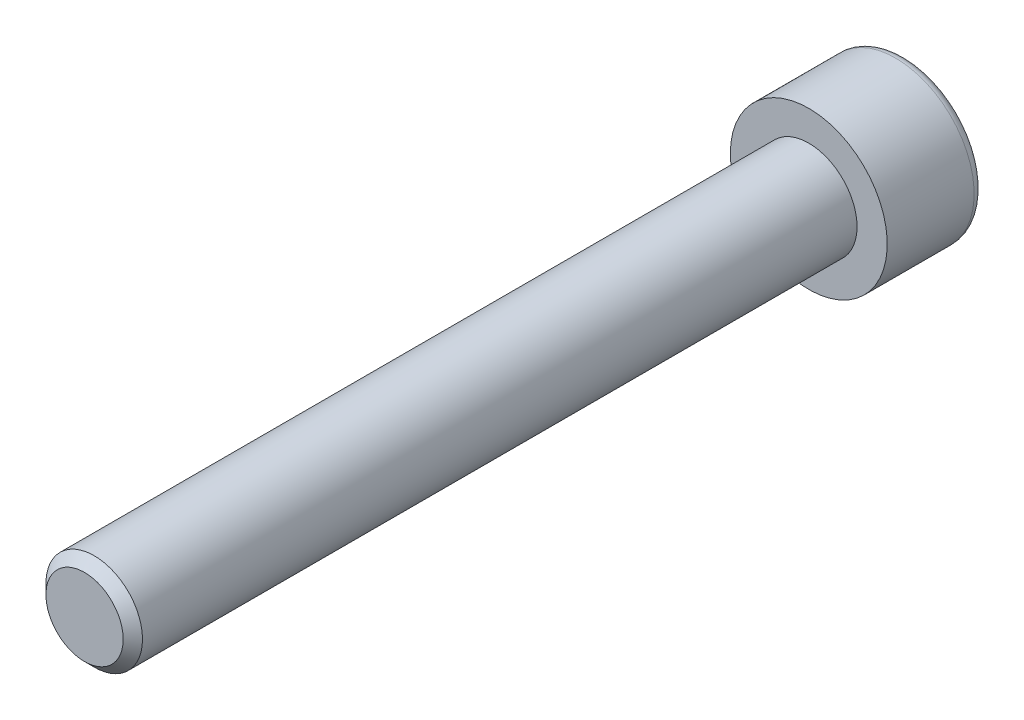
from build123d import *

# Parameters (mm, degrees)
ENLEV_MAT_EXTRU1_DEPTH = 4
ESQUISSE3_W            = 4
ESQUISSE3_H            = 60
CHANFREIN1_SIZE        = 0.8


with BuildPart() as part:
    # Esquisse1 → Base-R_volution (revolve)
    with BuildSketch(Plane(origin=(0, 0, 0), x_dir=(1, 0, 0), z_dir=(0, 1, 0)), mode=Mode.PRIVATE) as base_r_volution_sk:
        with BuildLine():
            Line((0, 0), (6.5, 0))
            Line((6.5, 0), (6.5, 7.2))
            ThreePointArc((6.5, 7.2), (6.265685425, 7.765685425), (5.7, 8))
            Line((5.7, 8), (0, 8))
            Line((0, 8), (0, 0))
        make_face()
    revolve(base_r_volution_sk.sketch.rotate(Axis((0, 0, 0), (0, 0, -1)), 180), axis=Axis((0, 0, 0), (0, 0, -1)))

    # Esquisse2 → enlev-mat-Extru1 (cut)
    with BuildSketch(Plane.XY.offset(-8)):
        Polygon((3, -1.732050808), (3, 1.732050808), (0, 3.464101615), (-3, 1.732050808), (-3, -1.732050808), (0, -3.464101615), align=None)
    extrude(amount=ENLEV_MAT_EXTRU1_DEPTH, mode=Mode.SUBTRACT)

    # Esquisse3 → Boss.-R_vol.1 (revolve)
    with BuildSketch(Plane(origin=(0, 0, 0), x_dir=(1, 0, 0), z_dir=(0, 1, 0))):
        with Locations((2, -30)):
            Rectangle(ESQUISSE3_W, ESQUISSE3_H)
    revolve(axis=Axis((0, 0, 0), (0, 0, 1)))

    # Chanfrein1
    chanfrein1_edges = [part.edges().sort_by_distance(p)[0] for p in [
        (-4, 0, 60),
    ]]
    chamfer(chanfrein1_edges, length=CHANFREIN1_SIZE)


solid = part.part
